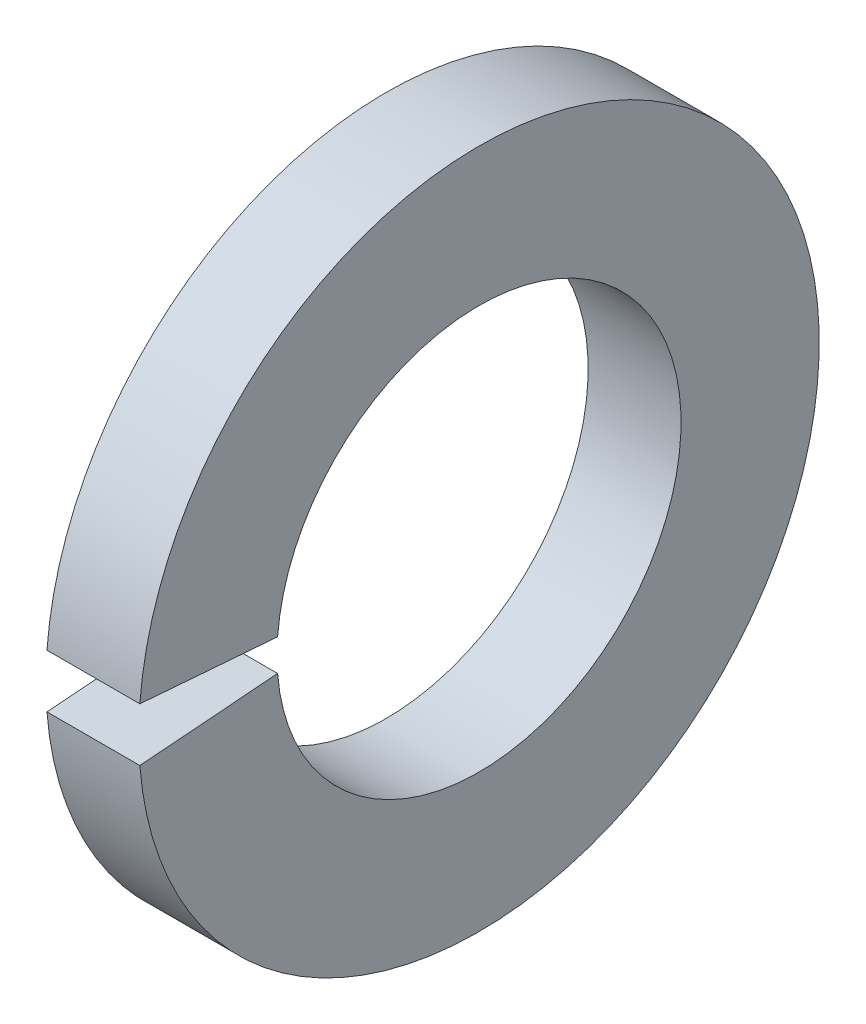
ISO-10303-21;
HEADER;
FILE_DESCRIPTION(('STEP AP214'),'2;1');
FILE_NAME('part.step','',(''),(''),'','','');
FILE_SCHEMA(('AUTOMOTIVE_DESIGN { 1 0 10303 214 1 1 1 1 }'));
ENDSEC;
DATA;
#1=APPLICATION_CONTEXT('core data for automotive mechanical design processes');
#2=APPLICATION_PROTOCOL_DEFINITION('international standard','automotive_design',2000,#1);
#3=PRODUCT_CONTEXT('',#1,'mechanical');
#4=PRODUCT('Part','Part','',(#3));
#5=PRODUCT_RELATED_PRODUCT_CATEGORY('part','',(#4));
#6=PRODUCT_DEFINITION_FORMATION('','',#4);
#7=PRODUCT_DEFINITION_CONTEXT('part definition',#1,'design');
#8=PRODUCT_DEFINITION('design','',#6,#7);
#9=PRODUCT_DEFINITION_SHAPE('','',#8);
#10=(LENGTH_UNIT() NAMED_UNIT(*) SI_UNIT(.MILLI.,.METRE.));
#11=(NAMED_UNIT(*) PLANE_ANGLE_UNIT() SI_UNIT($,.RADIAN.));
#12=(NAMED_UNIT(*) SI_UNIT($,.STERADIAN.) SOLID_ANGLE_UNIT());
#13=UNCERTAINTY_MEASURE_WITH_UNIT(LENGTH_MEASURE(1.E-05),#10,'distance_accuracy_value','');
#14=(GEOMETRIC_REPRESENTATION_CONTEXT(3) GLOBAL_UNCERTAINTY_ASSIGNED_CONTEXT((#13)) GLOBAL_UNIT_ASSIGNED_CONTEXT((#10,
#11,#12)) REPRESENTATION_CONTEXT('',''));
#15=CARTESIAN_POINT('',(0.,0.,0.));
#16=DIRECTION('',(0.,0.,1.));
#17=DIRECTION('',(1.,0.,0.));
#18=AXIS2_PLACEMENT_3D('',#15,#16,#17);
#19=CARTESIAN_POINT('',(-34.925,-8.60422844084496E-13,2.85882428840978E-12));
#20=DIRECTION('',(-0.999999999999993,0.,0.));
#21=DIRECTION('',(0.,0.,0.999999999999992));
#22=AXIS2_PLACEMENT_3D('',#19,#20,#21);
#23=CYLINDRICAL_SURFACE('',#22,2.2098);
#24=CARTESIAN_POINT('',(0.,0.,0.));
#25=DIRECTION('',(-0.999999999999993,0.,0.));
#26=DIRECTION('',(0.,0.,0.999999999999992));
#27=AXIS2_PLACEMENT_3D('',#24,#25,#26);
#28=CIRCLE('',#27,2.2098);
#29=CARTESIAN_POINT('',(-1.11065670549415E-12,0.173378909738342,2.20298792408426));
#30=VERTEX_POINT('',#29);
#31=CARTESIAN_POINT('',(-9.44123251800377E-13,-0.173378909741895,2.20298792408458));
#32=VERTEX_POINT('',#31);
#33=EDGE_CURVE('E87',#30,#32,#28,.T.);
#34=ORIENTED_EDGE('',*,*,#33,.F.);
#35=DIRECTION('',(-0.999999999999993,0.,0.));
#36=VECTOR('',#35,1.);
#37=CARTESIAN_POINT('',(-34.9250000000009,0.173378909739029,2.20298792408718));
#38=LINE('',#37,#36);
#39=CARTESIAN_POINT('',(-1.01600000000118,0.17337890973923,2.20298792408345));
#40=VERTEX_POINT('',#39);
#41=EDGE_CURVE('E101',#30,#40,#38,.T.);
#42=ORIENTED_EDGE('',*,*,#41,.T.);
#43=CARTESIAN_POINT('',(-1.01600000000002,4.44089209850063E-13,4.57966997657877E-13));
#44=DIRECTION('',(-0.999999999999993,0.,0.));
#45=DIRECTION('',(0.,0.,0.999999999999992));
#46=AXIS2_PLACEMENT_3D('',#43,#44,#45);
#47=CIRCLE('',#46,2.2098);
#48=CARTESIAN_POINT('',(-1.01600000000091,-0.173378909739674,2.20298792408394));
#49=VERTEX_POINT('',#48);
#50=EDGE_CURVE('E89',#40,#49,#47,.T.);
#51=ORIENTED_EDGE('',*,*,#50,.T.);
#52=DIRECTION('',(-0.999999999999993,0.,0.));
#53=VECTOR('',#52,1.);
#54=CARTESIAN_POINT('',(-34.9250000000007,-0.17337890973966,2.20298792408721));
#55=LINE('',#54,#53);
#56=EDGE_CURVE('E57',#32,#49,#55,.T.);
#57=ORIENTED_EDGE('',*,*,#56,.F.);
#58=EDGE_LOOP('',(#34,#42,#51,#57));
#59=FACE_BOUND('',#58,.T.);
#60=ADVANCED_FACE('F36',(#59),#23,.F.);
#61=CARTESIAN_POINT('',(0.,2.20979999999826,2.77555756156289E-13));
#62=DIRECTION('',(-0.999999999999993,0.,0.));
#63=DIRECTION('',(0.,0.,0.999999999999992));
#64=AXIS2_PLACEMENT_3D('',#61,#62,#63);
#65=PLANE('',#64);
#66=CARTESIAN_POINT('',(0.,0.,0.));
#67=DIRECTION('',(-0.999999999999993,0.,0.));
#68=DIRECTION('',(0.,0.,0.999999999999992));
#69=AXIS2_PLACEMENT_3D('',#66,#67,#68);
#70=CIRCLE('',#69,3.7211);
#71=CARTESIAN_POINT('',(-1.49966844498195E-12,0.291954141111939,3.70962909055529));
#72=VERTEX_POINT('',#71);
#73=CARTESIAN_POINT('',(-9.44123251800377E-13,-0.291954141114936,3.70962909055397));
#74=VERTEX_POINT('',#73);
#75=EDGE_CURVE('E93',#72,#74,#70,.T.);
#76=ORIENTED_EDGE('',*,*,#75,.F.);
#77=DIRECTION('',(0.,0.0784590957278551,0.996917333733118));
#78=VECTOR('',#77,1.);
#79=CARTESIAN_POINT('',(0.,0.,0.));
#80=LINE('',#79,#78);
#81=EDGE_CURVE('E81',#30,#72,#80,.T.);
#82=ORIENTED_EDGE('',*,*,#81,.F.);
#83=ORIENTED_EDGE('',*,*,#33,.T.);
#84=DIRECTION('',(0.,-0.0784590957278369,0.996917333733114));
#85=VECTOR('',#84,1.);
#86=CARTESIAN_POINT('',(0.,0.,0.));
#87=LINE('',#86,#85);
#88=EDGE_CURVE('E73',#32,#74,#87,.T.);
#89=ORIENTED_EDGE('',*,*,#88,.T.);
#90=EDGE_LOOP('',(#76,#82,#83,#89));
#91=FACE_BOUND('',#90,.T.);
#92=ADVANCED_FACE('F92',(#91),#65,.F.);
#93=CARTESIAN_POINT('',(-34.925,-8.60422844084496E-13,2.85882428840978E-12));
#94=DIRECTION('',(-0.999999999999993,0.,0.));
#95=DIRECTION('',(0.,0.,0.999999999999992));
#96=AXIS2_PLACEMENT_3D('',#93,#94,#95);
#97=CYLINDRICAL_SURFACE('',#96,3.7211);
#98=CARTESIAN_POINT('',(-1.01600000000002,4.44089209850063E-13,4.57966997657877E-13));
#99=DIRECTION('',(-0.999999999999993,0.,0.));
#100=DIRECTION('',(0.,0.,0.999999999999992));
#101=AXIS2_PLACEMENT_3D('',#98,#99,#100);
#102=CIRCLE('',#101,3.7211);
#103=CARTESIAN_POINT('',(-1.01600000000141,0.291954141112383,3.70962909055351));
#104=VERTEX_POINT('',#103);
#105=CARTESIAN_POINT('',(-1.01600000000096,-0.291954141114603,3.7096290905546));
#106=VERTEX_POINT('',#105);
#107=EDGE_CURVE('E95',#104,#106,#102,.T.);
#108=ORIENTED_EDGE('',*,*,#107,.F.);
#109=DIRECTION('',(-0.999999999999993,0.,0.));
#110=VECTOR('',#109,1.);
#111=CARTESIAN_POINT('',(-34.9250000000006,0.291954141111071,3.70962909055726));
#112=LINE('',#111,#110);
#113=EDGE_CURVE('E50',#104,#72,#112,.F.);
#114=ORIENTED_EDGE('',*,*,#113,.T.);
#115=ORIENTED_EDGE('',*,*,#75,.T.);
#116=DIRECTION('',(-0.999999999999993,0.,0.));
#117=VECTOR('',#116,1.);
#118=CARTESIAN_POINT('',(-34.9250000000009,-0.291954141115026,3.70962909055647));
#119=LINE('',#118,#117);
#120=EDGE_CURVE('E76',#106,#74,#119,.F.);
#121=ORIENTED_EDGE('',*,*,#120,.F.);
#122=EDGE_LOOP('',(#108,#114,#115,#121));
#123=FACE_BOUND('',#122,.T.);
#124=ADVANCED_FACE('F108',(#123),#97,.T.);
#125=CARTESIAN_POINT('',(-1.01600000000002,3.72109999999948,-1.13797860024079E-12));
#126=DIRECTION('',(0.999999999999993,0.,0.));
#127=DIRECTION('',(0.,0.,-0.999999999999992));
#128=AXIS2_PLACEMENT_3D('',#125,#126,#127);
#129=PLANE('',#128);
#130=ORIENTED_EDGE('',*,*,#50,.F.);
#131=DIRECTION('',(0.,0.0784590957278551,0.996917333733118));
#132=VECTOR('',#131,1.);
#133=CARTESIAN_POINT('',(-1.01600000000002,0.0229064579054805,0.291054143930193));
#134=LINE('',#133,#132);
#135=EDGE_CURVE('E11',#40,#104,#134,.T.);
#136=ORIENTED_EDGE('',*,*,#135,.T.);
#137=ORIENTED_EDGE('',*,*,#107,.T.);
#138=DIRECTION('',(0.,-0.0784590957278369,0.996917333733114));
#139=VECTOR('',#138,1.);
#140=CARTESIAN_POINT('',(-1.01600000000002,0.0229064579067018,-0.291054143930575));
#141=LINE('',#140,#139);
#142=EDGE_CURVE('E43',#49,#106,#141,.T.);
#143=ORIENTED_EDGE('',*,*,#142,.F.);
#144=EDGE_LOOP('',(#130,#136,#137,#143));
#145=FACE_BOUND('',#144,.T.);
#146=ADVANCED_FACE('F110',(#145),#129,.F.);
#147=CARTESIAN_POINT('',(-1.01600000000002,4.44089209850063E-13,4.57966997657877E-13));
#148=DIRECTION('',(0.,0.996917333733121,0.0784590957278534));
#149=DIRECTION('',(0.,-0.0784590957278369,0.996917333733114));
#150=AXIS2_PLACEMENT_3D('',#147,#148,#149);
#151=PLANE('',#150);
#152=ORIENTED_EDGE('',*,*,#56,.T.);
#153=ORIENTED_EDGE('',*,*,#142,.T.);
#154=ORIENTED_EDGE('',*,*,#120,.T.);
#155=ORIENTED_EDGE('',*,*,#88,.F.);
#156=EDGE_LOOP('',(#152,#153,#154,#155));
#157=FACE_BOUND('',#156,.T.);
#158=ADVANCED_FACE('F74',(#157),#151,.T.);
#159=CARTESIAN_POINT('',(-1.01600000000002,4.44089209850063E-13,4.57966997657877E-13));
#160=DIRECTION('',(0.,0.996917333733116,-0.0784590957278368));
#161=DIRECTION('',(0.,0.0784590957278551,0.996917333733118));
#162=AXIS2_PLACEMENT_3D('',#159,#160,#161);
#163=PLANE('',#162);
#164=ORIENTED_EDGE('',*,*,#81,.T.);
#165=ORIENTED_EDGE('',*,*,#113,.F.);
#166=ORIENTED_EDGE('',*,*,#135,.F.);
#167=ORIENTED_EDGE('',*,*,#41,.F.);
#168=EDGE_LOOP('',(#164,#165,#166,#167));
#169=FACE_BOUND('',#168,.T.);
#170=ADVANCED_FACE('F105',(#169),#163,.F.);
#171=CLOSED_SHELL('',(#60,#92,#124,#146,#158,#170));
#172=MANIFOLD_SOLID_BREP('B2',#171);
#173=ADVANCED_BREP_SHAPE_REPRESENTATION('',(#18,#172),#14);
#174=SHAPE_DEFINITION_REPRESENTATION(#9,#173);
ENDSEC;
END-ISO-10303-21;
